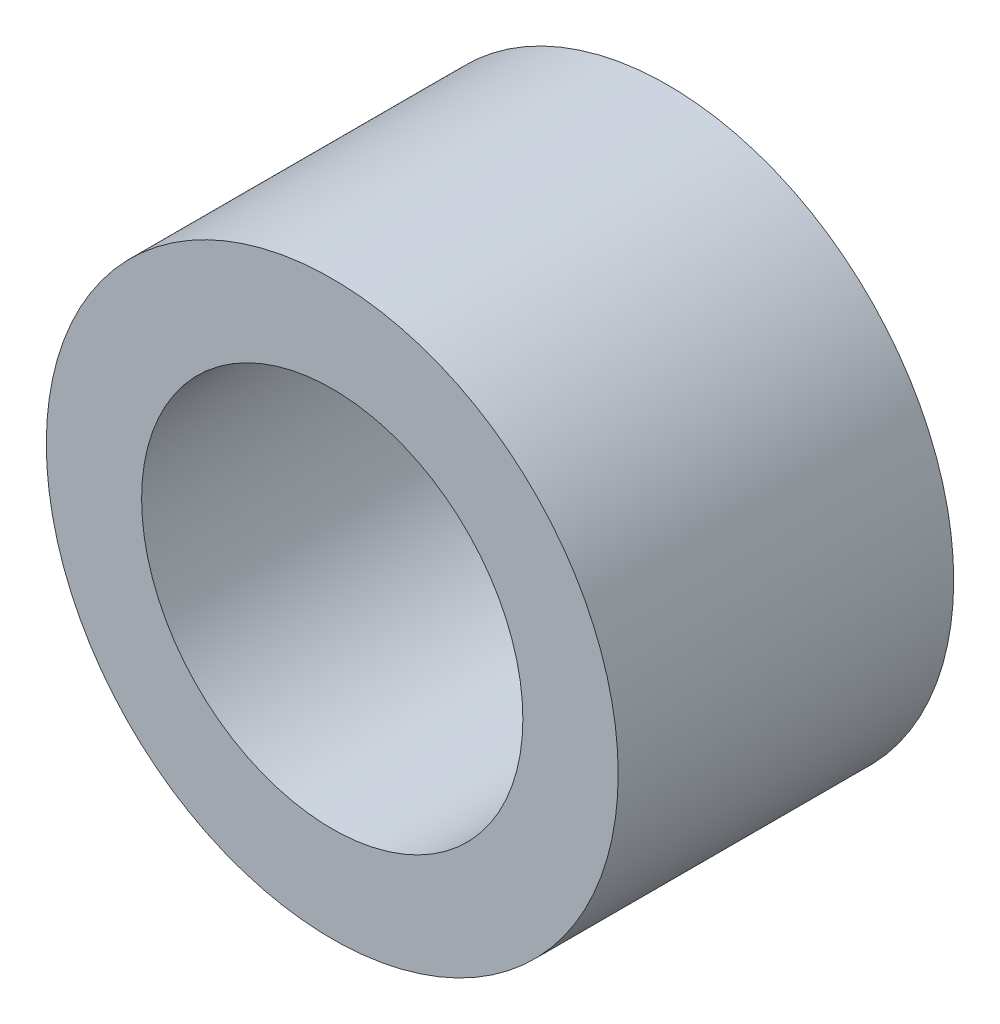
ISO-10303-21;
HEADER;
FILE_DESCRIPTION(('STEP AP214'),'2;1');
FILE_NAME('part.step','',(''),(''),'','','');
FILE_SCHEMA(('AUTOMOTIVE_DESIGN { 1 0 10303 214 1 1 1 1 }'));
ENDSEC;
DATA;
#1=APPLICATION_CONTEXT('core data for automotive mechanical design processes');
#2=APPLICATION_PROTOCOL_DEFINITION('international standard','automotive_design',2000,#1);
#3=PRODUCT_CONTEXT('',#1,'mechanical');
#4=PRODUCT('Part','Part','',(#3));
#5=PRODUCT_RELATED_PRODUCT_CATEGORY('part','',(#4));
#6=PRODUCT_DEFINITION_FORMATION('','',#4);
#7=PRODUCT_DEFINITION_CONTEXT('part definition',#1,'design');
#8=PRODUCT_DEFINITION('design','',#6,#7);
#9=PRODUCT_DEFINITION_SHAPE('','',#8);
#10=(LENGTH_UNIT() NAMED_UNIT(*) SI_UNIT(.MILLI.,.METRE.));
#11=(NAMED_UNIT(*) PLANE_ANGLE_UNIT() SI_UNIT($,.RADIAN.));
#12=(NAMED_UNIT(*) SI_UNIT($,.STERADIAN.) SOLID_ANGLE_UNIT());
#13=UNCERTAINTY_MEASURE_WITH_UNIT(LENGTH_MEASURE(1.E-05),#10,'distance_accuracy_value','');
#14=(GEOMETRIC_REPRESENTATION_CONTEXT(3) GLOBAL_UNCERTAINTY_ASSIGNED_CONTEXT((#13)) GLOBAL_UNIT_ASSIGNED_CONTEXT((#10,
#11,#12)) REPRESENTATION_CONTEXT('',''));
#15=CARTESIAN_POINT('',(0.,0.,0.));
#16=DIRECTION('',(0.,0.,1.));
#17=DIRECTION('',(1.,0.,0.));
#18=AXIS2_PLACEMENT_3D('',#15,#16,#17);
#19=CARTESIAN_POINT('',(0.,0.,5.58800000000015));
#20=DIRECTION('',(0.,0.,1.));
#21=DIRECTION('',(0.999999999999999,0.,0.));
#22=AXIS2_PLACEMENT_3D('',#19,#20,#21);
#23=PLANE('',#22);
#24=CARTESIAN_POINT('',(0.,0.,5.58800000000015));
#25=DIRECTION('',(0.,0.,1.));
#26=DIRECTION('',(0.999999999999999,0.,0.));
#27=AXIS2_PLACEMENT_3D('',#24,#25,#26);
#28=CIRCLE('',#27,4.7625);
#29=CARTESIAN_POINT('',(4.76250000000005,0.,5.58800000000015));
#30=VERTEX_POINT('',#29);
#31=EDGE_CURVE('E10',#30,#30,#28,.T.);
#32=ORIENTED_EDGE('',*,*,#31,.T.);
#33=EDGE_LOOP('',(#32));
#34=FACE_BOUND('',#33,.T.);
#35=CARTESIAN_POINT('',(0.,0.,5.58800000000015));
#36=DIRECTION('',(0.,0.,1.));
#37=DIRECTION('',(0.999999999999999,0.,0.));
#38=AXIS2_PLACEMENT_3D('',#35,#36,#37);
#39=CIRCLE('',#38,3.175);
#40=CARTESIAN_POINT('',(3.17500000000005,0.,5.58800000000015));
#41=VERTEX_POINT('',#40);
#42=EDGE_CURVE('E41',#41,#41,#39,.T.);
#43=ORIENTED_EDGE('',*,*,#42,.F.);
#44=EDGE_LOOP('',(#43));
#45=FACE_BOUND('',#44,.T.);
#46=ADVANCED_FACE('F30',(#34,#45),#23,.T.);
#47=CARTESIAN_POINT('',(-1.14491749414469E-13,0.,-4.44089209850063E-13));
#48=DIRECTION('',(0.,0.,1.));
#49=DIRECTION('',(0.999999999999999,0.,0.));
#50=AXIS2_PLACEMENT_3D('',#47,#48,#49);
#51=PLANE('',#50);
#52=CARTESIAN_POINT('',(-1.14491749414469E-13,0.,-4.44089209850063E-13));
#53=DIRECTION('',(0.,0.,1.));
#54=DIRECTION('',(0.999999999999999,0.,0.));
#55=AXIS2_PLACEMENT_3D('',#52,#53,#54);
#56=CIRCLE('',#55,4.7625);
#57=CARTESIAN_POINT('',(4.76249999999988,0.,-4.43560466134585E-13));
#58=VERTEX_POINT('',#57);
#59=EDGE_CURVE('E37',#58,#58,#56,.T.);
#60=ORIENTED_EDGE('',*,*,#59,.F.);
#61=EDGE_LOOP('',(#60));
#62=FACE_BOUND('',#61,.T.);
#63=CARTESIAN_POINT('',(-1.14491749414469E-13,0.,-4.44089209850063E-13));
#64=DIRECTION('',(0.,0.,1.));
#65=DIRECTION('',(0.999999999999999,0.,0.));
#66=AXIS2_PLACEMENT_3D('',#63,#64,#65);
#67=CIRCLE('',#66,3.175);
#68=CARTESIAN_POINT('',(3.17499999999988,0.,-4.43736714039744E-13));
#69=VERTEX_POINT('',#68);
#70=EDGE_CURVE('E45',#69,#69,#67,.T.);
#71=ORIENTED_EDGE('',*,*,#70,.T.);
#72=EDGE_LOOP('',(#71));
#73=FACE_BOUND('',#72,.T.);
#74=ADVANCED_FACE('F51',(#62,#73),#51,.F.);
#75=CARTESIAN_POINT('',(0.,0.,5.58800000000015));
#76=DIRECTION('',(0.,0.,-1.));
#77=DIRECTION('',(-0.999999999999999,0.,0.));
#78=AXIS2_PLACEMENT_3D('',#75,#76,#77);
#79=CYLINDRICAL_SURFACE('',#78,4.7625);
#80=ORIENTED_EDGE('',*,*,#31,.F.);
#81=EDGE_LOOP('',(#80));
#82=FACE_BOUND('',#81,.T.);
#83=ORIENTED_EDGE('',*,*,#59,.T.);
#84=EDGE_LOOP('',(#83));
#85=FACE_BOUND('',#84,.T.);
#86=ADVANCED_FACE('F32',(#82,#85),#79,.T.);
#87=CARTESIAN_POINT('',(0.,0.,5.58800000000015));
#88=DIRECTION('',(0.,0.,-1.));
#89=DIRECTION('',(-0.999999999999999,0.,0.));
#90=AXIS2_PLACEMENT_3D('',#87,#88,#89);
#91=CYLINDRICAL_SURFACE('',#90,3.175);
#92=ORIENTED_EDGE('',*,*,#42,.T.);
#93=EDGE_LOOP('',(#92));
#94=FACE_BOUND('',#93,.T.);
#95=ORIENTED_EDGE('',*,*,#70,.F.);
#96=EDGE_LOOP('',(#95));
#97=FACE_BOUND('',#96,.T.);
#98=ADVANCED_FACE('F53',(#94,#97),#91,.F.);
#99=CLOSED_SHELL('',(#46,#74,#86,#98));
#100=MANIFOLD_SOLID_BREP('B2',#99);
#101=ADVANCED_BREP_SHAPE_REPRESENTATION('',(#18,#100),#14);
#102=SHAPE_DEFINITION_REPRESENTATION(#9,#101);
ENDSEC;
END-ISO-10303-21;
